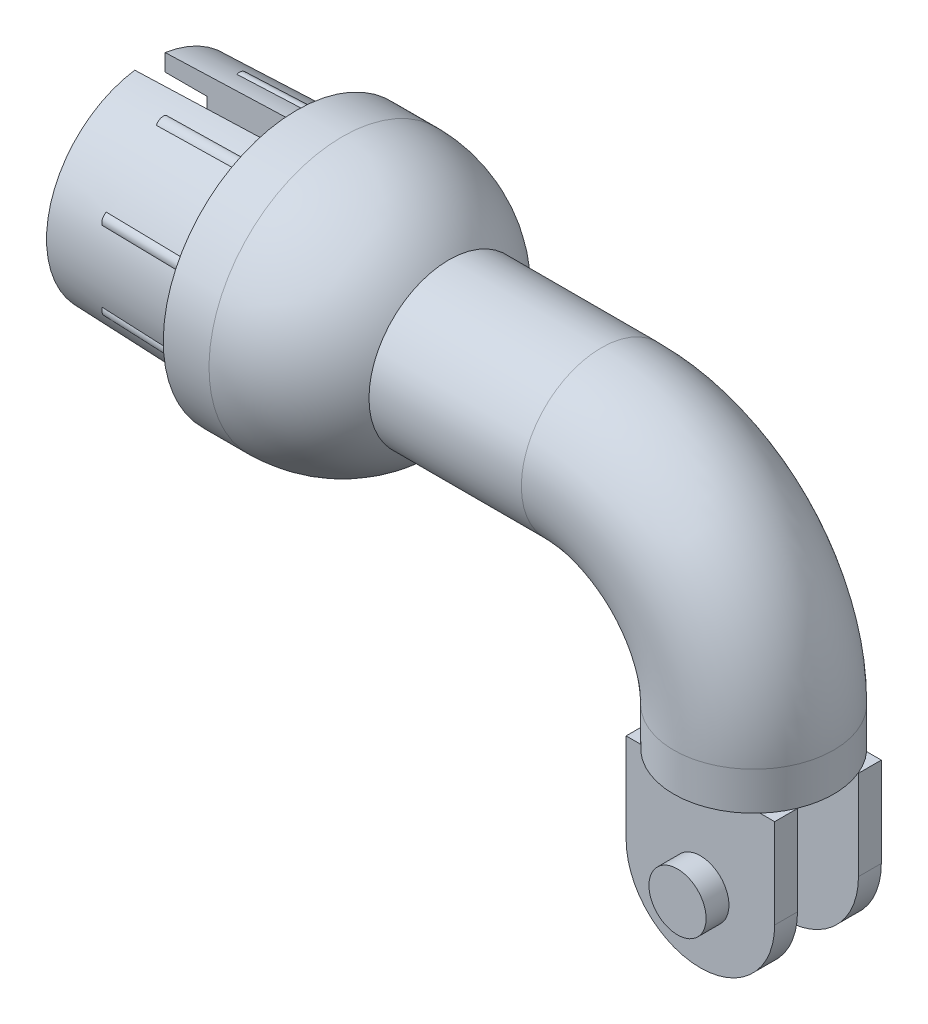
from build123d import *

# Parameters (mm, degrees)
SKETCH1_R           = 5.334
SKETCH4_R           = 7.239
BOSS_EXTRUDE1_DEPTH = 9.779
BOSS_EXTRUDE1_TAPER = 2
SHELL1_T            = -2.032
SKETCH7_R           = 0.508
CIRPATTERN1_COUNT   = 8
SKETCH8_R           = 5.7785
CUT_EXTRUDE1_DEPTH  = 2.794
SKETCH9_W           = 9.144
SKETCH9_H           = 2.032
CUT_EXTRUDE2_DEPTH  = 50.804244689
BOSS_EXTRUDE2_DEPTH = 1.524
SKETCH11_R          = 1.905
BOSS_EXTRUDE3_DEPTH = 1.524


with BuildPart() as part:
    # Base-Sweep: sweep along a path in Sketch2
    with BuildLine(Plane.XY) as base_sweep_path:
        Line((0, 6.35), (0, 8.89))
        ThreePointArc((0, 8.89), (-2.975795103, 16.074204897), (-10.16, 19.05))
        Line((-10.16, 19.05), (-25.4, 19.05))
    # Sketch1 → Base-Sweep (sweep)
    with BuildSketch(Plane(origin=(0, 6.35, 0), x_dir=(-1, 0, 0), z_dir=(0, 1, 0))):
        Circle(SKETCH1_R)
    sweep(path=base_sweep_path.line)

    # Sketch3 → Boss-Revolve1 (revolve)
    with BuildSketch(Plane.XY):
        with BuildLine():
            Line((-27.432, 27.94), (-30.48, 27.94))
            Line((-30.48, 27.94), (-30.48, 19.05))
            Line((-30.48, 19.05), (-18.542, 19.05))
            ThreePointArc((-18.542, 19.05), (-21.145820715, 25.336179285), (-27.432, 27.94))
        make_face()
    revolve(axis=Axis((-36.172167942, 19.05, 0), (-1, 0, 0)))

    # Sketch4 → Boss-Extrude1 (add)
    with BuildSketch(Plane.ZY.offset(30.48)):
        with Locations((0, 19.05)):
            Circle(SKETCH4_R)
    extrude(amount=BOSS_EXTRUDE1_DEPTH, taper=BOSS_EXTRUDE1_TAPER)

    # Shell1
    shell1_openings = [part.faces().sort_by_distance(p)[0] for p in [
        (-40.259, 19.05, 0),
        (0, 6.35, 0),
    ]]
    offset(amount=SHELL1_T, openings=shell1_openings, kind=Kind.INTERSECTION)

    # Boss-Sweep1: sweep along a path in Sketch6
    with BuildLine(Plane(origin=(0, 2.789807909, 6.735192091), x_dir=(1, 0, 0), z_dir=(0, 0.38268343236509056, 0.9238795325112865))) as boss_sweep1_path:
        Line((-36.83, 24.617158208), (-30.48, 24.838905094))
    # Sketch7 → Boss-Sweep1 (sweep)
    with BuildSketch(Plane.ZY.offset(30.48)):
        with Locations((-2.624442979, 25.385965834)):
            Circle(SKETCH7_R)
    boss_sweep1 = sweep(path=boss_sweep1_path.line)

    # CirPattern1: Boss-Sweep1 ×8 about axis
    cirpattern1_axis = Axis((-36.172167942, 19.05, 0), (-1, 0, 0))
    for i in range(1, CIRPATTERN1_COUNT):
        add(boss_sweep1.rotate(cirpattern1_axis, i * 360 / CIRPATTERN1_COUNT))

    # Sketch8 → Cut-Extrude1 (cut)
    with BuildSketch(Plane.ZY.offset(40.259)):
        with Locations(Location((0, 19.05, 0), (0, 0, 270))):
            Circle(SKETCH8_R)
    extrude(amount=-CUT_EXTRUDE1_DEPTH, mode=Mode.SUBTRACT)

    # Sketch9 → Cut-Extrude2 (cut, through all)
    with BuildSketch(Plane(origin=(0, 0, 0), x_dir=(1, 0, 0), z_dir=(0, 1, 0))):
        with Locations((-35.687, 0)):
            Rectangle(SKETCH9_W, SKETCH9_H)
    extrude(amount=CUT_EXTRUDE2_DEPTH, mode=Mode.SUBTRACT)

    # Sketch10 → Boss-Extrude2 (add)
    with BuildSketch(Plane(origin=(0, 12.319, -3.556), x_dir=(1, 0, 0), z_dir=(0, 0, -1))):
        with BuildLine():
            Line((-4.953, 5.969), (4.953, 5.969))
            Line((4.953, 5.969), (4.953, 11.938))
            ThreePointArc((4.953, 11.938), (0, 16.891), (-4.953, 11.938))
            Line((-4.953, 11.938), (-4.953, 5.969))
        make_face()
    boss_extrude2 = extrude(amount=-BOSS_EXTRUDE2_DEPTH)

    # Sketch11 → Boss-Extrude3 (add)
    with BuildSketch(Plane(origin=(0, 0, -3.556), x_dir=(-1, 0, 0), z_dir=(0, 0, -1))):
        with Locations(Location((0, 0, 0), (0, 0, 270))):
            Circle(SKETCH11_R)
    boss_extrude3 = extrude(amount=BOSS_EXTRUDE3_DEPTH)

    # Mirror1: Boss-Extrude2, Boss-Extrude3 across plane
    add(boss_extrude2.mirror(Plane.XY))
    add(boss_extrude3.mirror(Plane.XY))


solid = part.part
